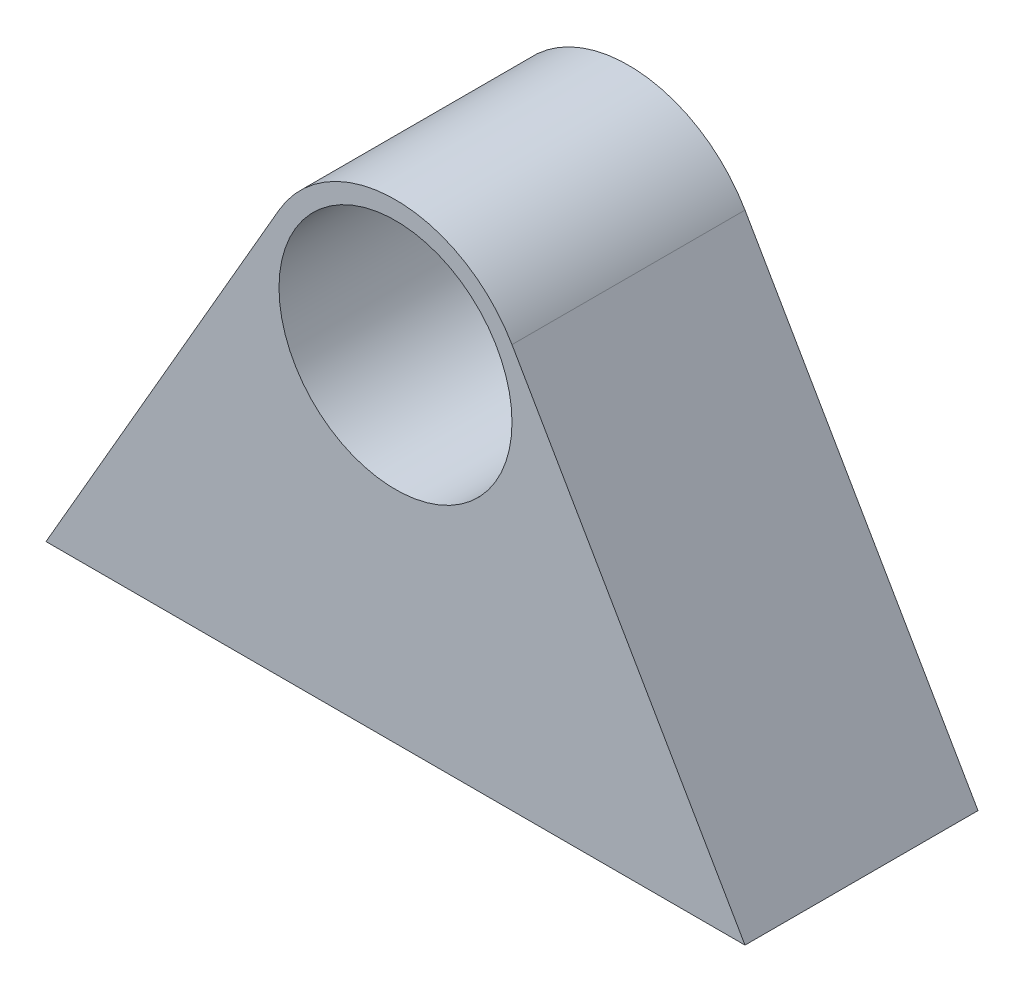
from build123d import *

# Parameters (mm, degrees)
BOSS_EXTRUDE1_DEPTH = 10
SKETCH2_R           = 5
CUT_EXTRUDE1_DEPTH  = 38.527767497


with BuildPart() as part:
    # Sketch1 → Boss-Extrude1 (new body)
    with BuildSketch(Plane.XY):
        with BuildLine():
            Line((0, 0), (10, 17.320508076))
            ThreePointArc((10, 17.320508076), (15, 20.207259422), (20, 17.320508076))
            Line((20, 17.320508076), (30, 0))
            Line((30, 0), (0, 0))
        make_face()
    extrude(amount=BOSS_EXTRUDE1_DEPTH)

    # Sketch2 → Cut-Extrude1 (cut, through all)
    with BuildSketch(Plane.XY.offset(10)):
        with Locations((15, 14.43375673)):
            Circle(SKETCH2_R)
    extrude(amount=-CUT_EXTRUDE1_DEPTH, mode=Mode.SUBTRACT)


solid = part.part
